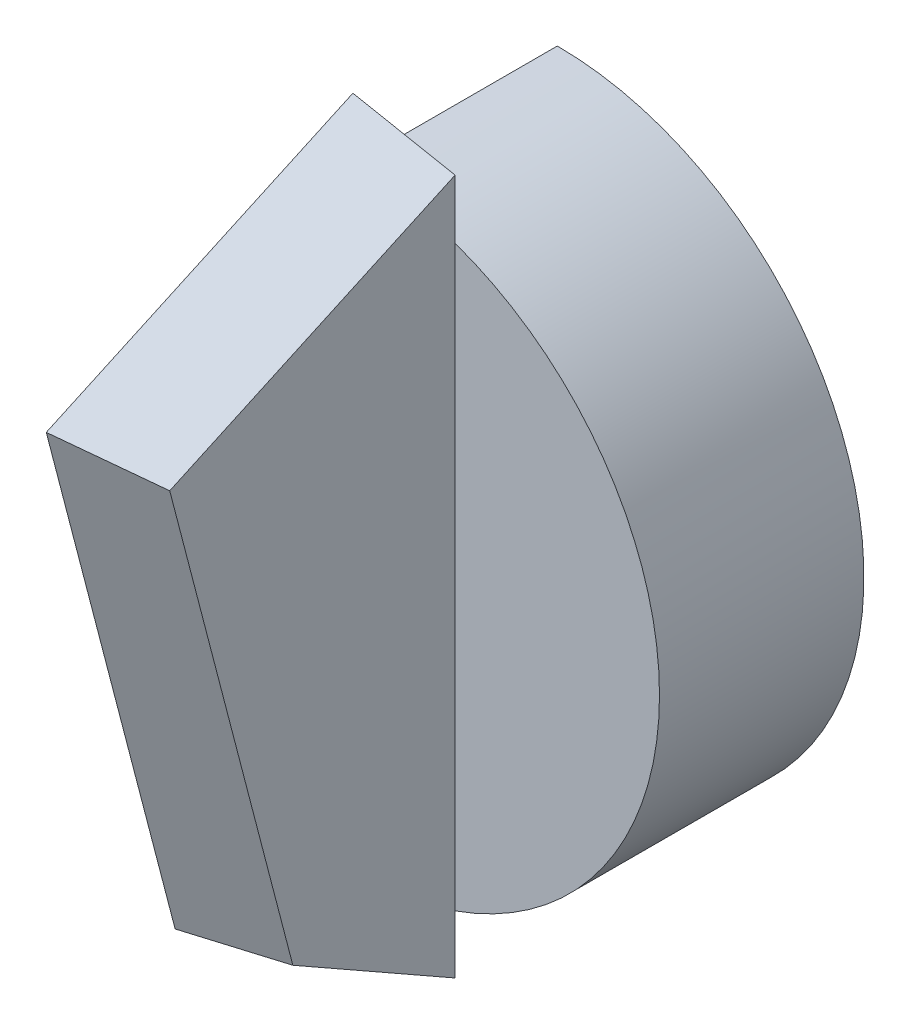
ISO-10303-21;
HEADER;
FILE_DESCRIPTION(('STEP AP214'),'2;1');
FILE_NAME('part.step','',(''),(''),'','','');
FILE_SCHEMA(('AUTOMOTIVE_DESIGN { 1 0 10303 214 1 1 1 1 }'));
ENDSEC;
DATA;
#1=APPLICATION_CONTEXT('core data for automotive mechanical design processes');
#2=APPLICATION_PROTOCOL_DEFINITION('international standard','automotive_design',2000,#1);
#3=PRODUCT_CONTEXT('',#1,'mechanical');
#4=PRODUCT('Part','Part','',(#3));
#5=PRODUCT_RELATED_PRODUCT_CATEGORY('part','',(#4));
#6=PRODUCT_DEFINITION_FORMATION('','',#4);
#7=PRODUCT_DEFINITION_CONTEXT('part definition',#1,'design');
#8=PRODUCT_DEFINITION('design','',#6,#7);
#9=PRODUCT_DEFINITION_SHAPE('','',#8);
#10=(LENGTH_UNIT() NAMED_UNIT(*) SI_UNIT(.MILLI.,.METRE.));
#11=(NAMED_UNIT(*) PLANE_ANGLE_UNIT() SI_UNIT($,.RADIAN.));
#12=(NAMED_UNIT(*) SI_UNIT($,.STERADIAN.) SOLID_ANGLE_UNIT());
#13=UNCERTAINTY_MEASURE_WITH_UNIT(LENGTH_MEASURE(1.E-05),#10,'distance_accuracy_value','');
#14=(GEOMETRIC_REPRESENTATION_CONTEXT(3) GLOBAL_UNCERTAINTY_ASSIGNED_CONTEXT((#13)) GLOBAL_UNIT_ASSIGNED_CONTEXT((#10,
#11,#12)) REPRESENTATION_CONTEXT('',''));
#15=CARTESIAN_POINT('',(0.,0.,0.));
#16=DIRECTION('',(0.,0.,1.));
#17=DIRECTION('',(1.,0.,0.));
#18=AXIS2_PLACEMENT_3D('',#15,#16,#17);
#19=CARTESIAN_POINT('',(0.,0.,10.));
#20=DIRECTION('',(0.,0.,-1.));
#21=DIRECTION('',(-1.,0.,0.));
#22=AXIS2_PLACEMENT_3D('',#19,#20,#21);
#23=CYLINDRICAL_SURFACE('',#22,15.);
#24=CARTESIAN_POINT('',(0.,0.,0.));
#25=DIRECTION('',(0.,0.,1.));
#26=DIRECTION('',(1.,0.,0.));
#27=AXIS2_PLACEMENT_3D('',#24,#25,#26);
#28=CIRCLE('',#27,15.);
#29=CARTESIAN_POINT('',(0.,-15.,0.));
#30=VERTEX_POINT('',#29);
#31=CARTESIAN_POINT('',(0.,15.,0.));
#32=VERTEX_POINT('',#31);
#33=EDGE_CURVE('E100',#30,#32,#28,.T.);
#34=ORIENTED_EDGE('',*,*,#33,.T.);
#35=DIRECTION('',(0.,0.,-1.));
#36=VECTOR('',#35,1.);
#37=CARTESIAN_POINT('',(0.,15.,10.));
#38=LINE('',#37,#36);
#39=CARTESIAN_POINT('',(0.,15.,10.));
#40=VERTEX_POINT('',#39);
#41=EDGE_CURVE('E41',#40,#32,#38,.T.);
#42=ORIENTED_EDGE('',*,*,#41,.F.);
#43=CARTESIAN_POINT('',(0.,0.,10.));
#44=DIRECTION('',(0.,0.,1.));
#45=DIRECTION('',(1.,0.,0.));
#46=AXIS2_PLACEMENT_3D('',#43,#44,#45);
#47=CIRCLE('',#46,15.);
#48=CARTESIAN_POINT('',(5.,14.142135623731,10.));
#49=VERTEX_POINT('',#48);
#50=EDGE_CURVE('E232',#49,#40,#47,.T.);
#51=ORIENTED_EDGE('',*,*,#50,.F.);
#52=CARTESIAN_POINT('',(5.,-14.142135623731,10.));
#53=VERTEX_POINT('',#52);
#54=EDGE_CURVE('E129',#53,#49,#47,.T.);
#55=ORIENTED_EDGE('',*,*,#54,.F.);
#56=CARTESIAN_POINT('',(0.,-15.,10.));
#57=VERTEX_POINT('',#56);
#58=EDGE_CURVE('E237',#57,#53,#47,.T.);
#59=ORIENTED_EDGE('',*,*,#58,.F.);
#60=DIRECTION('',(0.,0.,-1.));
#61=VECTOR('',#60,1.);
#62=CARTESIAN_POINT('',(0.,-15.,10.));
#63=LINE('',#62,#61);
#64=EDGE_CURVE('E235',#57,#30,#63,.T.);
#65=ORIENTED_EDGE('',*,*,#64,.T.);
#66=EDGE_LOOP('',(#34,#42,#51,#55,#59,#65));
#67=FACE_BOUND('',#66,.T.);
#68=ADVANCED_FACE('F31',(#67),#23,.T.);
#69=CARTESIAN_POINT('',(0.,15.,10.));
#70=DIRECTION('',(1.,0.,0.));
#71=DIRECTION('',(0.,1.,0.));
#72=AXIS2_PLACEMENT_3D('',#69,#70,#71);
#73=PLANE('',#72);
#74=DIRECTION('',(0.,-1.,0.));
#75=VECTOR('',#74,1.);
#76=CARTESIAN_POINT('',(0.,15.,0.));
#77=LINE('',#76,#75);
#78=EDGE_CURVE('E228',#32,#30,#77,.T.);
#79=ORIENTED_EDGE('',*,*,#78,.T.);
#80=ORIENTED_EDGE('',*,*,#64,.F.);
#81=DIRECTION('',(0.,1.,0.));
#82=VECTOR('',#81,1.);
#83=CARTESIAN_POINT('',(0.,18.,10.));
#84=LINE('',#83,#82);
#85=CARTESIAN_POINT('',(0.,-18.,10.));
#86=VERTEX_POINT('',#85);
#87=EDGE_CURVE('E114',#86,#57,#84,.T.);
#88=ORIENTED_EDGE('',*,*,#87,.F.);
#89=DIRECTION('',(0.,0.493839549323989,0.869553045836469));
#90=VECTOR('',#89,1.);
#91=CARTESIAN_POINT('',(0.,-17.9044018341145,10.1683293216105));
#92=LINE('',#91,#90);
#93=CARTESIAN_POINT('',(0.,-13.0616045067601,18.6955304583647));
#94=VERTEX_POINT('',#93);
#95=EDGE_CURVE('E92',#94,#86,#92,.F.);
#96=ORIENTED_EDGE('',*,*,#95,.F.);
#97=DIRECTION('',(0.,0.967680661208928,0.252178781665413));
#98=VECTOR('',#97,1.);
#99=CARTESIAN_POINT('',(0.,-5.39288429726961,20.6940084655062));
#100=LINE('',#99,#98);
#101=CARTESIAN_POINT('',(0.,11.1304120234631,25.));
#102=VERTEX_POINT('',#101);
#103=EDGE_CURVE('E35',#102,#94,#100,.F.);
#104=ORIENTED_EDGE('',*,*,#103,.F.);
#105=DIRECTION('',(0.,0.416383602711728,-0.909189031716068));
#106=VECTOR('',#105,1.);
#107=CARTESIAN_POINT('',(0.,18.6649585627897,8.54803832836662));
#108=LINE('',#107,#106);
#109=CARTESIAN_POINT('',(0.,18.,10.));
#110=VERTEX_POINT('',#109);
#111=EDGE_CURVE('E90',#110,#102,#108,.F.);
#112=ORIENTED_EDGE('',*,*,#111,.F.);
#113=EDGE_CURVE('E119',#40,#110,#84,.T.);
#114=ORIENTED_EDGE('',*,*,#113,.F.);
#115=ORIENTED_EDGE('',*,*,#41,.T.);
#116=EDGE_LOOP('',(#79,#80,#88,#96,#104,#112,#114,#115));
#117=FACE_BOUND('',#116,.T.);
#118=ADVANCED_FACE('F87',(#117),#73,.F.);
#119=CARTESIAN_POINT('',(0.,0.,10.));
#120=DIRECTION('',(0.,0.,1.));
#121=DIRECTION('',(1.,0.,0.));
#122=AXIS2_PLACEMENT_3D('',#119,#120,#121);
#123=PLANE('',#122);
#124=DIRECTION('',(0.,1.,0.));
#125=VECTOR('',#124,1.);
#126=CARTESIAN_POINT('',(5.,18.,10.));
#127=LINE('',#126,#125);
#128=EDGE_CURVE('E11',#53,#49,#127,.T.);
#129=ORIENTED_EDGE('',*,*,#128,.F.);
#130=ORIENTED_EDGE('',*,*,#54,.T.);
#131=EDGE_LOOP('',(#129,#130));
#132=FACE_BOUND('',#131,.T.);
#133=ADVANCED_FACE('F158',(#132),#123,.T.);
#134=CARTESIAN_POINT('',(0.,0.,0.));
#135=DIRECTION('',(0.,0.,1.));
#136=DIRECTION('',(1.,0.,0.));
#137=AXIS2_PLACEMENT_3D('',#134,#135,#136);
#138=PLANE('',#137);
#139=ORIENTED_EDGE('',*,*,#33,.F.);
#140=ORIENTED_EDGE('',*,*,#78,.F.);
#141=EDGE_LOOP('',(#139,#140));
#142=FACE_BOUND('',#141,.T.);
#143=ADVANCED_FACE('F148',(#142),#138,.F.);
#144=CARTESIAN_POINT('',(5.,18.,10.));
#145=DIRECTION('',(0.,0.,1.));
#146=DIRECTION('',(0.,-1.,0.));
#147=AXIS2_PLACEMENT_3D('',#144,#145,#146);
#148=PLANE('',#147);
#149=ORIENTED_EDGE('',*,*,#87,.T.);
#150=ORIENTED_EDGE('',*,*,#58,.T.);
#151=CARTESIAN_POINT('',(5.,-16.9861056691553,10.));
#152=VERTEX_POINT('',#151);
#153=EDGE_CURVE('E43',#152,#53,#127,.T.);
#154=ORIENTED_EDGE('',*,*,#153,.F.);
#155=DIRECTION('',(0.980053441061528,0.198734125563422,0.));
#156=VECTOR('',#155,1.);
#157=CARTESIAN_POINT('',(11.814246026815,-15.6043205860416,10.));
#158=LINE('',#157,#156);
#159=EDGE_CURVE('E111',#152,#86,#158,.F.);
#160=ORIENTED_EDGE('',*,*,#159,.T.);
#161=EDGE_LOOP('',(#149,#150,#154,#160));
#162=FACE_BOUND('',#161,.T.);
#163=ADVANCED_FACE('F141',(#162),#148,.F.);
#164=CARTESIAN_POINT('',(5.,17.0303062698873,10.));
#165=VERTEX_POINT('',#164);
#166=EDGE_CURVE('E44',#49,#165,#127,.T.);
#167=ORIENTED_EDGE('',*,*,#166,.F.);
#168=ORIENTED_EDGE('',*,*,#50,.T.);
#169=ORIENTED_EDGE('',*,*,#113,.T.);
#170=DIRECTION('',(0.981708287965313,-0.190391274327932,0.));
#171=VECTOR('',#170,1.);
#172=CARTESIAN_POINT('',(-0.124286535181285,18.0241039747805,10.));
#173=LINE('',#172,#171);
#174=EDGE_CURVE('E106',#165,#110,#173,.F.);
#175=ORIENTED_EDGE('',*,*,#174,.F.);
#176=EDGE_LOOP('',(#167,#168,#169,#175));
#177=FACE_BOUND('',#176,.T.);
#178=ADVANCED_FACE('F139',(#177),#148,.F.);
#179=CARTESIAN_POINT('',(0.,18.6649585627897,8.54803832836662));
#180=DIRECTION('',(0.173648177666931,0.895376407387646,0.410057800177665));
#181=DIRECTION('',(0.,-0.416383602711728,0.909189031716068));
#182=AXIS2_PLACEMENT_3D('',#179,#180,#181);
#183=PLANE('',#182);
#184=ORIENTED_EDGE('',*,*,#111,.T.);
#185=DIRECTION('',(-0.974517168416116,0.0961927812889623,0.202640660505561));
#186=VECTOR('',#185,1.);
#187=CARTESIAN_POINT('',(2.39925230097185,10.8935862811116,24.5011005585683));
#188=LINE('',#187,#186);
#189=CARTESIAN_POINT('',(5.,10.6368713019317,23.9603022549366));
#190=VERTEX_POINT('',#189);
#191=EDGE_CURVE('E94',#190,#102,#188,.T.);
#192=ORIENTED_EDGE('',*,*,#191,.F.);
#193=DIRECTION('',(0.,0.416383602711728,-0.909189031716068));
#194=VECTOR('',#193,1.);
#195=CARTESIAN_POINT('',(5.,17.8633857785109,8.18094001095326));
#196=LINE('',#195,#194);
#197=EDGE_CURVE('E112',#165,#190,#196,.F.);
#198=ORIENTED_EDGE('',*,*,#197,.F.);
#199=ORIENTED_EDGE('',*,*,#174,.T.);
#200=EDGE_LOOP('',(#184,#192,#198,#199));
#201=FACE_BOUND('',#200,.T.);
#202=ADVANCED_FACE('F104',(#201),#183,.T.);
#203=CARTESIAN_POINT('',(0.,-5.39288429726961,20.6940084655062));
#204=DIRECTION('',(0.173648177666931,-0.248347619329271,0.952979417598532));
#205=DIRECTION('',(0.,-0.967680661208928,-0.252178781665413));
#206=AXIS2_PLACEMENT_3D('',#203,#204,#205);
#207=PLANE('',#206);
#208=ORIENTED_EDGE('',*,*,#103,.T.);
#209=DIRECTION('',(-0.982168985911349,-0.114464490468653,0.149137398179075));
#210=VECTOR('',#209,1.);
#211=CARTESIAN_POINT('',(0.704604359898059,-12.9794881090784,18.5885398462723));
#212=LINE('',#211,#210);
#213=CARTESIAN_POINT('',(5.,-12.4788916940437,17.9363057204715));
#214=VERTEX_POINT('',#213);
#215=EDGE_CURVE('E101',#214,#94,#212,.T.);
#216=ORIENTED_EDGE('',*,*,#215,.F.);
#217=DIRECTION('',(0.,0.967680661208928,0.252178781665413));
#218=VECTOR('',#217,1.);
#219=CARTESIAN_POINT('',(5.,-5.17055468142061,19.8408674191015));
#220=LINE('',#219,#218);
#221=EDGE_CURVE('E96',#190,#214,#220,.F.);
#222=ORIENTED_EDGE('',*,*,#221,.F.);
#223=ORIENTED_EDGE('',*,*,#191,.T.);
#224=EDGE_LOOP('',(#208,#216,#222,#223));
#225=FACE_BOUND('',#224,.T.);
#226=ADVANCED_FACE('F95',(#225),#207,.T.);
#227=CARTESIAN_POINT('',(0.,-17.9044018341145,10.1683293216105));
#228=DIRECTION('',(0.173648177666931,-0.856342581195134,0.486337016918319));
#229=DIRECTION('',(0.,-0.493839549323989,-0.869553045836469));
#230=AXIS2_PLACEMENT_3D('',#227,#228,#229);
#231=PLANE('',#230);
#232=ORIENTED_EDGE('',*,*,#95,.T.);
#233=ORIENTED_EDGE('',*,*,#159,.F.);
#234=DIRECTION('',(0.,0.493839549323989,0.869553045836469));
#235=VECTOR('',#234,1.);
#236=CARTESIAN_POINT('',(5.,-17.1377735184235,9.73294313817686));
#237=LINE('',#236,#235);
#238=EDGE_CURVE('E116',#214,#152,#237,.F.);
#239=ORIENTED_EDGE('',*,*,#238,.F.);
#240=ORIENTED_EDGE('',*,*,#215,.T.);
#241=EDGE_LOOP('',(#232,#233,#239,#240));
#242=FACE_BOUND('',#241,.T.);
#243=ADVANCED_FACE('F33',(#242),#231,.T.);
#244=CARTESIAN_POINT('',(5.,11.1304120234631,25.));
#245=DIRECTION('',(1.,0.,0.));
#246=DIRECTION('',(0.,0.,-1.));
#247=AXIS2_PLACEMENT_3D('',#244,#245,#246);
#248=PLANE('',#247);
#249=ORIENTED_EDGE('',*,*,#197,.T.);
#250=ORIENTED_EDGE('',*,*,#221,.T.);
#251=ORIENTED_EDGE('',*,*,#238,.T.);
#252=ORIENTED_EDGE('',*,*,#153,.T.);
#253=ORIENTED_EDGE('',*,*,#128,.T.);
#254=ORIENTED_EDGE('',*,*,#166,.T.);
#255=EDGE_LOOP('',(#249,#250,#251,#252,#253,#254));
#256=FACE_BOUND('',#255,.T.);
#257=ADVANCED_FACE('F138',(#256),#248,.T.);
#258=CLOSED_SHELL('',(#68,#118,#133,#143,#163,#178,#202,#226,#243,#257));
#259=MANIFOLD_SOLID_BREP('B2',#258);
#260=ADVANCED_BREP_SHAPE_REPRESENTATION('',(#18,#259),#14);
#261=SHAPE_DEFINITION_REPRESENTATION(#9,#260);
ENDSEC;
END-ISO-10303-21;
